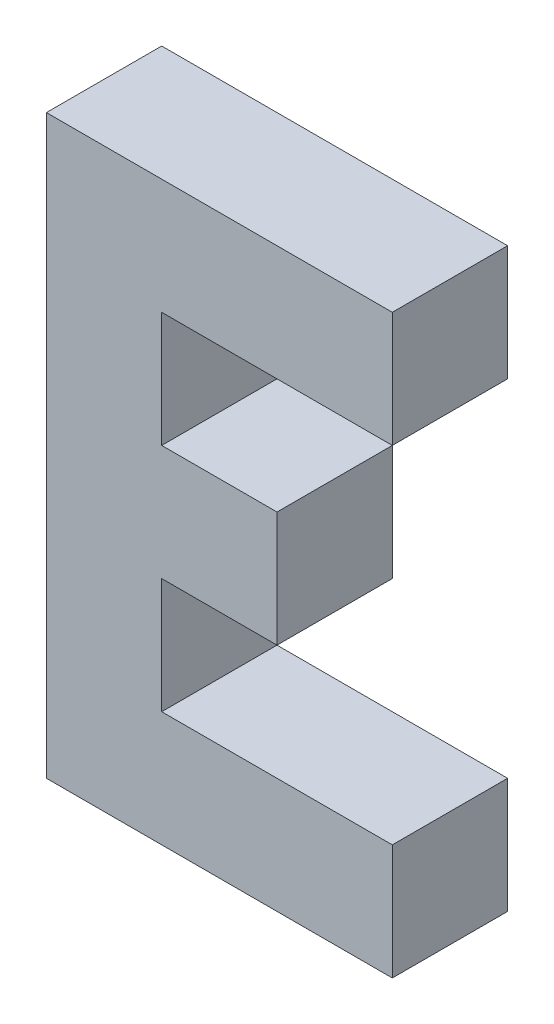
ISO-10303-21;
HEADER;
FILE_DESCRIPTION(('STEP AP214'),'2;1');
FILE_NAME('part.step','',(''),(''),'','','');
FILE_SCHEMA(('AUTOMOTIVE_DESIGN { 1 0 10303 214 1 1 1 1 }'));
ENDSEC;
DATA;
#1=APPLICATION_CONTEXT('core data for automotive mechanical design processes');
#2=APPLICATION_PROTOCOL_DEFINITION('international standard','automotive_design',2000,#1);
#3=PRODUCT_CONTEXT('',#1,'mechanical');
#4=PRODUCT('Part','Part','',(#3));
#5=PRODUCT_RELATED_PRODUCT_CATEGORY('part','',(#4));
#6=PRODUCT_DEFINITION_FORMATION('','',#4);
#7=PRODUCT_DEFINITION_CONTEXT('part definition',#1,'design');
#8=PRODUCT_DEFINITION('design','',#6,#7);
#9=PRODUCT_DEFINITION_SHAPE('','',#8);
#10=(LENGTH_UNIT() NAMED_UNIT(*) SI_UNIT(.MILLI.,.METRE.));
#11=(NAMED_UNIT(*) PLANE_ANGLE_UNIT() SI_UNIT($,.RADIAN.));
#12=(NAMED_UNIT(*) SI_UNIT($,.STERADIAN.) SOLID_ANGLE_UNIT());
#13=UNCERTAINTY_MEASURE_WITH_UNIT(LENGTH_MEASURE(1.E-05),#10,'distance_accuracy_value','');
#14=(GEOMETRIC_REPRESENTATION_CONTEXT(3) GLOBAL_UNCERTAINTY_ASSIGNED_CONTEXT((#13)) GLOBAL_UNIT_ASSIGNED_CONTEXT((#10,
#11,#12)) REPRESENTATION_CONTEXT('',''));
#15=CARTESIAN_POINT('',(0.,0.,0.));
#16=DIRECTION('',(0.,0.,1.));
#17=DIRECTION('',(1.,0.,0.));
#18=AXIS2_PLACEMENT_3D('',#15,#16,#17);
#19=CARTESIAN_POINT('',(0.,0.,10.));
#20=DIRECTION('',(1.,0.,0.));
#21=DIRECTION('',(0.,0.,-1.));
#22=AXIS2_PLACEMENT_3D('',#19,#20,#21);
#23=PLANE('',#22);
#24=DIRECTION('',(0.,-1.,0.));
#25=VECTOR('',#24,1.);
#26=CARTESIAN_POINT('',(0.,0.,0.));
#27=LINE('',#26,#25);
#28=CARTESIAN_POINT('',(0.,50.,0.));
#29=VERTEX_POINT('',#28);
#30=CARTESIAN_POINT('',(0.,0.,0.));
#31=VERTEX_POINT('',#30);
#32=EDGE_CURVE('E153',#29,#31,#27,.T.);
#33=ORIENTED_EDGE('',*,*,#32,.T.);
#34=DIRECTION('',(0.,0.,-1.));
#35=VECTOR('',#34,1.);
#36=CARTESIAN_POINT('',(0.,0.,10.));
#37=LINE('',#36,#35);
#38=CARTESIAN_POINT('',(0.,0.,10.));
#39=VERTEX_POINT('',#38);
#40=EDGE_CURVE('E11',#39,#31,#37,.T.);
#41=ORIENTED_EDGE('',*,*,#40,.F.);
#42=DIRECTION('',(0.,-1.,0.));
#43=VECTOR('',#42,1.);
#44=CARTESIAN_POINT('',(0.,0.,10.));
#45=LINE('',#44,#43);
#46=CARTESIAN_POINT('',(0.,50.,10.));
#47=VERTEX_POINT('',#46);
#48=EDGE_CURVE('E175',#47,#39,#45,.T.);
#49=ORIENTED_EDGE('',*,*,#48,.F.);
#50=DIRECTION('',(0.,0.,-1.));
#51=VECTOR('',#50,1.);
#52=CARTESIAN_POINT('',(0.,50.,10.));
#53=LINE('',#52,#51);
#54=EDGE_CURVE('E149',#47,#29,#53,.T.);
#55=ORIENTED_EDGE('',*,*,#54,.T.);
#56=EDGE_LOOP('',(#33,#41,#49,#55));
#57=FACE_BOUND('',#56,.T.);
#58=ADVANCED_FACE('F33',(#57),#23,.F.);
#59=CARTESIAN_POINT('',(0.,0.,10.));
#60=DIRECTION('',(0.,1.,0.));
#61=DIRECTION('',(0.,0.,1.));
#62=AXIS2_PLACEMENT_3D('',#59,#60,#61);
#63=PLANE('',#62);
#64=DIRECTION('',(1.,0.,0.));
#65=VECTOR('',#64,1.);
#66=CARTESIAN_POINT('',(0.,0.,0.));
#67=LINE('',#66,#65);
#68=CARTESIAN_POINT('',(30.,0.,0.));
#69=VERTEX_POINT('',#68);
#70=EDGE_CURVE('E156',#31,#69,#67,.T.);
#71=ORIENTED_EDGE('',*,*,#70,.T.);
#72=DIRECTION('',(0.,0.,-1.));
#73=VECTOR('',#72,1.);
#74=CARTESIAN_POINT('',(30.,0.,10.));
#75=LINE('',#74,#73);
#76=CARTESIAN_POINT('',(30.,0.,10.));
#77=VERTEX_POINT('',#76);
#78=EDGE_CURVE('E41',#77,#69,#75,.T.);
#79=ORIENTED_EDGE('',*,*,#78,.F.);
#80=DIRECTION('',(1.,0.,0.));
#81=VECTOR('',#80,1.);
#82=CARTESIAN_POINT('',(0.,0.,10.));
#83=LINE('',#82,#81);
#84=EDGE_CURVE('E104',#39,#77,#83,.T.);
#85=ORIENTED_EDGE('',*,*,#84,.F.);
#86=ORIENTED_EDGE('',*,*,#40,.T.);
#87=EDGE_LOOP('',(#71,#79,#85,#86));
#88=FACE_BOUND('',#87,.T.);
#89=ADVANCED_FACE('F253',(#88),#63,.F.);
#90=CARTESIAN_POINT('',(30.,0.,10.));
#91=DIRECTION('',(-1.,0.,0.));
#92=DIRECTION('',(0.,0.,1.));
#93=AXIS2_PLACEMENT_3D('',#90,#91,#92);
#94=PLANE('',#93);
#95=DIRECTION('',(0.,1.,0.));
#96=VECTOR('',#95,1.);
#97=CARTESIAN_POINT('',(30.,0.,0.));
#98=LINE('',#97,#96);
#99=CARTESIAN_POINT('',(30.,10.,0.));
#100=VERTEX_POINT('',#99);
#101=EDGE_CURVE('E158',#69,#100,#98,.T.);
#102=ORIENTED_EDGE('',*,*,#101,.T.);
#103=DIRECTION('',(0.,0.,-1.));
#104=VECTOR('',#103,1.);
#105=CARTESIAN_POINT('',(30.,10.,10.));
#106=LINE('',#105,#104);
#107=CARTESIAN_POINT('',(30.,10.,10.));
#108=VERTEX_POINT('',#107);
#109=EDGE_CURVE('E194',#108,#100,#106,.T.);
#110=ORIENTED_EDGE('',*,*,#109,.F.);
#111=DIRECTION('',(0.,1.,0.));
#112=VECTOR('',#111,1.);
#113=CARTESIAN_POINT('',(30.,0.,10.));
#114=LINE('',#113,#112);
#115=EDGE_CURVE('E202',#77,#108,#114,.T.);
#116=ORIENTED_EDGE('',*,*,#115,.F.);
#117=ORIENTED_EDGE('',*,*,#78,.T.);
#118=EDGE_LOOP('',(#102,#110,#116,#117));
#119=FACE_BOUND('',#118,.T.);
#120=ADVANCED_FACE('F200',(#119),#94,.F.);
#121=CARTESIAN_POINT('',(30.,10.,10.));
#122=DIRECTION('',(0.,-1.,0.));
#123=DIRECTION('',(1.,0.,0.));
#124=AXIS2_PLACEMENT_3D('',#121,#122,#123);
#125=PLANE('',#124);
#126=DIRECTION('',(-1.,0.,0.));
#127=VECTOR('',#126,1.);
#128=CARTESIAN_POINT('',(30.,10.,0.));
#129=LINE('',#128,#127);
#130=CARTESIAN_POINT('',(10.,10.,0.));
#131=VERTEX_POINT('',#130);
#132=EDGE_CURVE('E160',#100,#131,#129,.T.);
#133=ORIENTED_EDGE('',*,*,#132,.T.);
#134=DIRECTION('',(0.,0.,-1.));
#135=VECTOR('',#134,1.);
#136=CARTESIAN_POINT('',(10.,10.,10.));
#137=LINE('',#136,#135);
#138=CARTESIAN_POINT('',(10.,10.,10.));
#139=VERTEX_POINT('',#138);
#140=EDGE_CURVE('E191',#139,#131,#137,.T.);
#141=ORIENTED_EDGE('',*,*,#140,.F.);
#142=DIRECTION('',(-1.,0.,0.));
#143=VECTOR('',#142,1.);
#144=CARTESIAN_POINT('',(30.,10.,10.));
#145=LINE('',#144,#143);
#146=EDGE_CURVE('E220',#108,#139,#145,.T.);
#147=ORIENTED_EDGE('',*,*,#146,.F.);
#148=ORIENTED_EDGE('',*,*,#109,.T.);
#149=EDGE_LOOP('',(#133,#141,#147,#148));
#150=FACE_BOUND('',#149,.T.);
#151=ADVANCED_FACE('F211',(#150),#125,.F.);
#152=CARTESIAN_POINT('',(9.99999999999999,20.,10.));
#153=DIRECTION('',(-1.,0.,0.));
#154=DIRECTION('',(0.,-1.,0.));
#155=AXIS2_PLACEMENT_3D('',#152,#153,#154);
#156=PLANE('',#155);
#157=DIRECTION('',(0.,1.,0.));
#158=VECTOR('',#157,1.);
#159=CARTESIAN_POINT('',(9.99999999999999,20.,0.));
#160=LINE('',#159,#158);
#161=CARTESIAN_POINT('',(9.99999999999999,20.,0.));
#162=VERTEX_POINT('',#161);
#163=EDGE_CURVE('E162',#131,#162,#160,.T.);
#164=ORIENTED_EDGE('',*,*,#163,.T.);
#165=DIRECTION('',(0.,0.,-1.));
#166=VECTOR('',#165,1.);
#167=CARTESIAN_POINT('',(9.99999999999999,20.,10.));
#168=LINE('',#167,#166);
#169=CARTESIAN_POINT('',(9.99999999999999,20.,10.));
#170=VERTEX_POINT('',#169);
#171=EDGE_CURVE('E188',#170,#162,#168,.T.);
#172=ORIENTED_EDGE('',*,*,#171,.F.);
#173=DIRECTION('',(0.,1.,0.));
#174=VECTOR('',#173,1.);
#175=CARTESIAN_POINT('',(9.99999999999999,20.,10.));
#176=LINE('',#175,#174);
#177=EDGE_CURVE('E217',#139,#170,#176,.T.);
#178=ORIENTED_EDGE('',*,*,#177,.F.);
#179=ORIENTED_EDGE('',*,*,#140,.T.);
#180=EDGE_LOOP('',(#164,#172,#178,#179));
#181=FACE_BOUND('',#180,.T.);
#182=ADVANCED_FACE('F215',(#181),#156,.F.);
#183=CARTESIAN_POINT('',(20.,20.,10.));
#184=DIRECTION('',(0.,1.,0.));
#185=DIRECTION('',(0.,0.,1.));
#186=AXIS2_PLACEMENT_3D('',#183,#184,#185);
#187=PLANE('',#186);
#188=DIRECTION('',(1.,0.,0.));
#189=VECTOR('',#188,1.);
#190=CARTESIAN_POINT('',(20.,20.,0.));
#191=LINE('',#190,#189);
#192=CARTESIAN_POINT('',(20.,20.,0.));
#193=VERTEX_POINT('',#192);
#194=EDGE_CURVE('E164',#162,#193,#191,.T.);
#195=ORIENTED_EDGE('',*,*,#194,.T.);
#196=DIRECTION('',(0.,0.,-1.));
#197=VECTOR('',#196,1.);
#198=CARTESIAN_POINT('',(20.,20.,10.));
#199=LINE('',#198,#197);
#200=CARTESIAN_POINT('',(20.,20.,10.));
#201=VERTEX_POINT('',#200);
#202=EDGE_CURVE('E185',#201,#193,#199,.T.);
#203=ORIENTED_EDGE('',*,*,#202,.F.);
#204=DIRECTION('',(1.,0.,0.));
#205=VECTOR('',#204,1.);
#206=CARTESIAN_POINT('',(20.,20.,10.));
#207=LINE('',#206,#205);
#208=EDGE_CURVE('E219',#170,#201,#207,.T.);
#209=ORIENTED_EDGE('',*,*,#208,.F.);
#210=ORIENTED_EDGE('',*,*,#171,.T.);
#211=EDGE_LOOP('',(#195,#203,#209,#210));
#212=FACE_BOUND('',#211,.T.);
#213=ADVANCED_FACE('F266',(#212),#187,.F.);
#214=CARTESIAN_POINT('',(20.,30.,10.));
#215=DIRECTION('',(-1.,0.,0.));
#216=DIRECTION('',(0.,0.,1.));
#217=AXIS2_PLACEMENT_3D('',#214,#215,#216);
#218=PLANE('',#217);
#219=DIRECTION('',(0.,1.,0.));
#220=VECTOR('',#219,1.);
#221=CARTESIAN_POINT('',(20.,30.,0.));
#222=LINE('',#221,#220);
#223=CARTESIAN_POINT('',(20.,30.,0.));
#224=VERTEX_POINT('',#223);
#225=EDGE_CURVE('E166',#193,#224,#222,.T.);
#226=ORIENTED_EDGE('',*,*,#225,.T.);
#227=DIRECTION('',(0.,0.,-1.));
#228=VECTOR('',#227,1.);
#229=CARTESIAN_POINT('',(20.,30.,10.));
#230=LINE('',#229,#228);
#231=CARTESIAN_POINT('',(20.,30.,10.));
#232=VERTEX_POINT('',#231);
#233=EDGE_CURVE('E182',#232,#224,#230,.T.);
#234=ORIENTED_EDGE('',*,*,#233,.F.);
#235=DIRECTION('',(0.,1.,0.));
#236=VECTOR('',#235,1.);
#237=CARTESIAN_POINT('',(20.,30.,10.));
#238=LINE('',#237,#236);
#239=EDGE_CURVE('E222',#201,#232,#238,.T.);
#240=ORIENTED_EDGE('',*,*,#239,.F.);
#241=ORIENTED_EDGE('',*,*,#202,.T.);
#242=EDGE_LOOP('',(#226,#234,#240,#241));
#243=FACE_BOUND('',#242,.T.);
#244=ADVANCED_FACE('F269',(#243),#218,.F.);
#245=CARTESIAN_POINT('',(20.,30.,10.));
#246=DIRECTION('',(0.,-1.,0.));
#247=DIRECTION('',(0.,0.,-1.));
#248=AXIS2_PLACEMENT_3D('',#245,#246,#247);
#249=PLANE('',#248);
#250=DIRECTION('',(-1.,0.,0.));
#251=VECTOR('',#250,1.);
#252=CARTESIAN_POINT('',(20.,30.,0.));
#253=LINE('',#252,#251);
#254=CARTESIAN_POINT('',(10.,30.,0.));
#255=VERTEX_POINT('',#254);
#256=EDGE_CURVE('E168',#224,#255,#253,.T.);
#257=ORIENTED_EDGE('',*,*,#256,.T.);
#258=DIRECTION('',(0.,0.,-1.));
#259=VECTOR('',#258,1.);
#260=CARTESIAN_POINT('',(10.,30.,10.));
#261=LINE('',#260,#259);
#262=CARTESIAN_POINT('',(10.,30.,10.));
#263=VERTEX_POINT('',#262);
#264=EDGE_CURVE('E179',#263,#255,#261,.T.);
#265=ORIENTED_EDGE('',*,*,#264,.F.);
#266=DIRECTION('',(-1.,0.,0.));
#267=VECTOR('',#266,1.);
#268=CARTESIAN_POINT('',(20.,30.,10.));
#269=LINE('',#268,#267);
#270=EDGE_CURVE('E228',#232,#263,#269,.T.);
#271=ORIENTED_EDGE('',*,*,#270,.F.);
#272=ORIENTED_EDGE('',*,*,#233,.T.);
#273=EDGE_LOOP('',(#257,#265,#271,#272));
#274=FACE_BOUND('',#273,.T.);
#275=ADVANCED_FACE('F234',(#274),#249,.F.);
#276=CARTESIAN_POINT('',(10.,40.,10.));
#277=DIRECTION('',(-1.,0.,0.));
#278=DIRECTION('',(0.,-1.,0.));
#279=AXIS2_PLACEMENT_3D('',#276,#277,#278);
#280=PLANE('',#279);
#281=DIRECTION('',(0.,1.,0.));
#282=VECTOR('',#281,1.);
#283=CARTESIAN_POINT('',(10.,40.,0.));
#284=LINE('',#283,#282);
#285=CARTESIAN_POINT('',(10.,40.,0.));
#286=VERTEX_POINT('',#285);
#287=EDGE_CURVE('E170',#255,#286,#284,.T.);
#288=ORIENTED_EDGE('',*,*,#287,.T.);
#289=DIRECTION('',(0.,0.,-1.));
#290=VECTOR('',#289,1.);
#291=CARTESIAN_POINT('',(10.,40.,10.));
#292=LINE('',#291,#290);
#293=CARTESIAN_POINT('',(10.,40.,10.));
#294=VERTEX_POINT('',#293);
#295=EDGE_CURVE('E144',#294,#286,#292,.T.);
#296=ORIENTED_EDGE('',*,*,#295,.F.);
#297=DIRECTION('',(0.,1.,0.));
#298=VECTOR('',#297,1.);
#299=CARTESIAN_POINT('',(10.,40.,10.));
#300=LINE('',#299,#298);
#301=EDGE_CURVE('E135',#263,#294,#300,.T.);
#302=ORIENTED_EDGE('',*,*,#301,.F.);
#303=ORIENTED_EDGE('',*,*,#264,.T.);
#304=EDGE_LOOP('',(#288,#296,#302,#303));
#305=FACE_BOUND('',#304,.T.);
#306=ADVANCED_FACE('F238',(#305),#280,.F.);
#307=CARTESIAN_POINT('',(30.,40.,10.));
#308=DIRECTION('',(0.,1.,0.));
#309=DIRECTION('',(0.,0.,1.));
#310=AXIS2_PLACEMENT_3D('',#307,#308,#309);
#311=PLANE('',#310);
#312=DIRECTION('',(1.,0.,0.));
#313=VECTOR('',#312,1.);
#314=CARTESIAN_POINT('',(30.,40.,0.));
#315=LINE('',#314,#313);
#316=CARTESIAN_POINT('',(30.,40.,0.));
#317=VERTEX_POINT('',#316);
#318=EDGE_CURVE('E143',#286,#317,#315,.T.);
#319=ORIENTED_EDGE('',*,*,#318,.T.);
#320=DIRECTION('',(0.,0.,-1.));
#321=VECTOR('',#320,1.);
#322=CARTESIAN_POINT('',(30.,40.,10.));
#323=LINE('',#322,#321);
#324=CARTESIAN_POINT('',(30.,40.,10.));
#325=VERTEX_POINT('',#324);
#326=EDGE_CURVE('E140',#325,#317,#323,.T.);
#327=ORIENTED_EDGE('',*,*,#326,.F.);
#328=DIRECTION('',(1.,0.,0.));
#329=VECTOR('',#328,1.);
#330=CARTESIAN_POINT('',(30.,40.,10.));
#331=LINE('',#330,#329);
#332=EDGE_CURVE('E129',#294,#325,#331,.T.);
#333=ORIENTED_EDGE('',*,*,#332,.F.);
#334=ORIENTED_EDGE('',*,*,#295,.T.);
#335=EDGE_LOOP('',(#319,#327,#333,#334));
#336=FACE_BOUND('',#335,.T.);
#337=ADVANCED_FACE('F141',(#336),#311,.F.);
#338=CARTESIAN_POINT('',(30.,40.,10.));
#339=DIRECTION('',(-1.,0.,0.));
#340=DIRECTION('',(0.,0.,1.));
#341=AXIS2_PLACEMENT_3D('',#338,#339,#340);
#342=PLANE('',#341);
#343=DIRECTION('',(0.,1.,0.));
#344=VECTOR('',#343,1.);
#345=CARTESIAN_POINT('',(30.,40.,0.));
#346=LINE('',#345,#344);
#347=CARTESIAN_POINT('',(30.,50.,0.));
#348=VERTEX_POINT('',#347);
#349=EDGE_CURVE('E90',#317,#348,#346,.T.);
#350=ORIENTED_EDGE('',*,*,#349,.T.);
#351=DIRECTION('',(0.,0.,-1.));
#352=VECTOR('',#351,1.);
#353=CARTESIAN_POINT('',(30.,50.,10.));
#354=LINE('',#353,#352);
#355=CARTESIAN_POINT('',(30.,50.,10.));
#356=VERTEX_POINT('',#355);
#357=EDGE_CURVE('E145',#356,#348,#354,.T.);
#358=ORIENTED_EDGE('',*,*,#357,.F.);
#359=DIRECTION('',(0.,1.,0.));
#360=VECTOR('',#359,1.);
#361=CARTESIAN_POINT('',(30.,40.,10.));
#362=LINE('',#361,#360);
#363=EDGE_CURVE('E133',#325,#356,#362,.T.);
#364=ORIENTED_EDGE('',*,*,#363,.F.);
#365=ORIENTED_EDGE('',*,*,#326,.T.);
#366=EDGE_LOOP('',(#350,#358,#364,#365));
#367=FACE_BOUND('',#366,.T.);
#368=ADVANCED_FACE('F147',(#367),#342,.F.);
#369=CARTESIAN_POINT('',(0.,50.,10.));
#370=DIRECTION('',(0.,-1.,0.));
#371=DIRECTION('',(0.,0.,-1.));
#372=AXIS2_PLACEMENT_3D('',#369,#370,#371);
#373=PLANE('',#372);
#374=DIRECTION('',(-1.,0.,0.));
#375=VECTOR('',#374,1.);
#376=CARTESIAN_POINT('',(0.,50.,0.));
#377=LINE('',#376,#375);
#378=EDGE_CURVE('E96',#348,#29,#377,.T.);
#379=ORIENTED_EDGE('',*,*,#378,.T.);
#380=ORIENTED_EDGE('',*,*,#54,.F.);
#381=DIRECTION('',(-1.,0.,0.));
#382=VECTOR('',#381,1.);
#383=CARTESIAN_POINT('',(0.,50.,10.));
#384=LINE('',#383,#382);
#385=EDGE_CURVE('E49',#356,#47,#384,.T.);
#386=ORIENTED_EDGE('',*,*,#385,.F.);
#387=ORIENTED_EDGE('',*,*,#357,.T.);
#388=EDGE_LOOP('',(#379,#380,#386,#387));
#389=FACE_BOUND('',#388,.T.);
#390=ADVANCED_FACE('F242',(#389),#373,.F.);
#391=CARTESIAN_POINT('',(0.,0.,10.));
#392=DIRECTION('',(0.,0.,-1.));
#393=DIRECTION('',(-1.,0.,0.));
#394=AXIS2_PLACEMENT_3D('',#391,#392,#393);
#395=PLANE('',#394);
#396=ORIENTED_EDGE('',*,*,#48,.T.);
#397=ORIENTED_EDGE('',*,*,#84,.T.);
#398=ORIENTED_EDGE('',*,*,#115,.T.);
#399=ORIENTED_EDGE('',*,*,#146,.T.);
#400=ORIENTED_EDGE('',*,*,#177,.T.);
#401=ORIENTED_EDGE('',*,*,#208,.T.);
#402=ORIENTED_EDGE('',*,*,#239,.T.);
#403=ORIENTED_EDGE('',*,*,#270,.T.);
#404=ORIENTED_EDGE('',*,*,#301,.T.);
#405=ORIENTED_EDGE('',*,*,#332,.T.);
#406=ORIENTED_EDGE('',*,*,#363,.T.);
#407=ORIENTED_EDGE('',*,*,#385,.T.);
#408=EDGE_LOOP('',(#396,#397,#398,#399,#400,#401,#402,#403,#404,#405,#406,#407));
#409=FACE_BOUND('',#408,.T.);
#410=ADVANCED_FACE('F131',(#409),#395,.F.);
#411=CARTESIAN_POINT('',(0.,0.,0.));
#412=DIRECTION('',(0.,0.,-1.));
#413=DIRECTION('',(-1.,0.,0.));
#414=AXIS2_PLACEMENT_3D('',#411,#412,#413);
#415=PLANE('',#414);
#416=ORIENTED_EDGE('',*,*,#32,.F.);
#417=ORIENTED_EDGE('',*,*,#378,.F.);
#418=ORIENTED_EDGE('',*,*,#349,.F.);
#419=ORIENTED_EDGE('',*,*,#318,.F.);
#420=ORIENTED_EDGE('',*,*,#287,.F.);
#421=ORIENTED_EDGE('',*,*,#256,.F.);
#422=ORIENTED_EDGE('',*,*,#225,.F.);
#423=ORIENTED_EDGE('',*,*,#194,.F.);
#424=ORIENTED_EDGE('',*,*,#163,.F.);
#425=ORIENTED_EDGE('',*,*,#132,.F.);
#426=ORIENTED_EDGE('',*,*,#101,.F.);
#427=ORIENTED_EDGE('',*,*,#70,.F.);
#428=EDGE_LOOP('',(#416,#417,#418,#419,#420,#421,#422,#423,#424,#425,#426,#427));
#429=FACE_BOUND('',#428,.T.);
#430=ADVANCED_FACE('F206',(#429),#415,.T.);
#431=CLOSED_SHELL('',(#58,#89,#120,#151,#182,#213,#244,#275,#306,#337,#368,#390,#410,#430));
#432=MANIFOLD_SOLID_BREP('B2',#431);
#433=ADVANCED_BREP_SHAPE_REPRESENTATION('',(#18,#432),#14);
#434=SHAPE_DEFINITION_REPRESENTATION(#9,#433);
ENDSEC;
END-ISO-10303-21;
